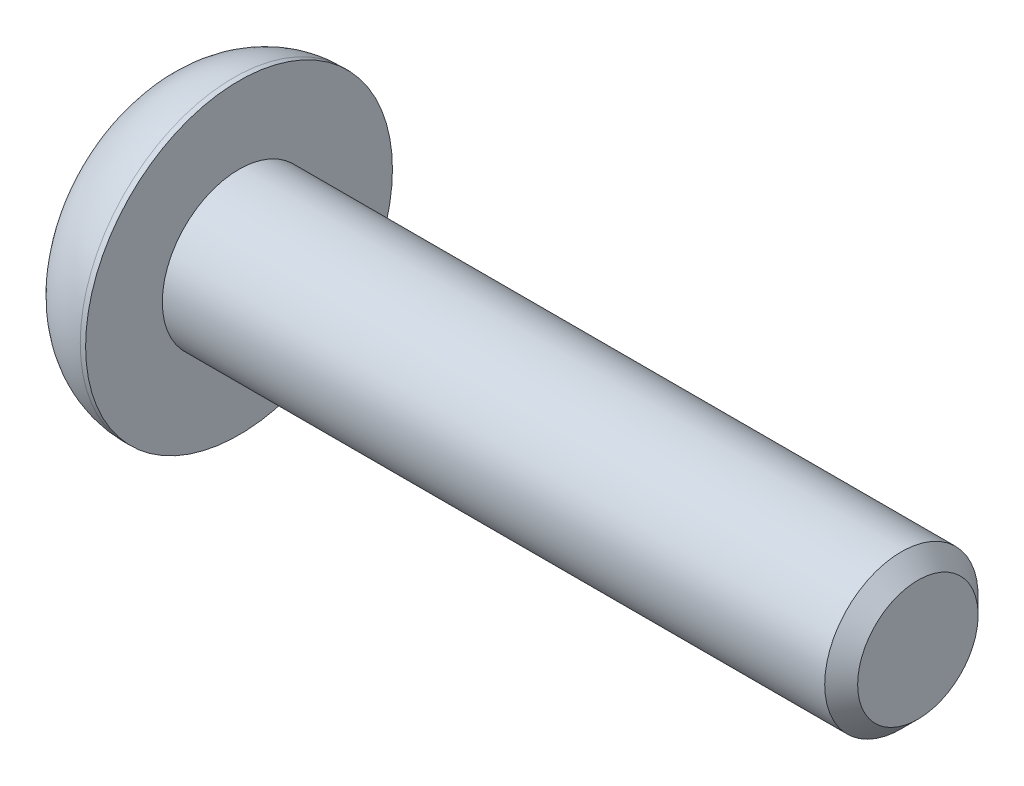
from build123d import *

# Parameters (mm, degrees)
EXTRUSION1_DEPTH = 1.495


with BuildPart() as part:
    # Esquisse1 → R_volution1 (revolve)
    with BuildSketch(Plane.XY, mode=Mode.PRIVATE) as r_volution1_sk:
        with BuildLine():
            Line((0, 0), (0, 1.84))
            ThreePointArc((0, 1.84), (0.632649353, 3.367350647), (2.16, 4))
            Line((2.16, 4), (2.3, 4))
            Line((2.3, 4), (2.3, 2))
            Line((2.3, 2), (19.5705, 2))
            Line((19.5705, 2), (20, 1.5705))
            Line((20, 1.5705), (20, 0))
            Line((20, 0), (0, 0))
        make_face()
    revolve(r_volution1_sk.sketch.rotate(Axis((20, 0, 0), (-1, 0, 0)), 270), axis=Axis((20, 0, 0), (-1, 0, 0)))

    # Esquisse2 → Extrusion1 (cut)
    with BuildSketch(Plane(origin=(0, 0, 0), x_dir=(0, 0, -1), z_dir=(1, 0, 0))):
        Polygon((-1.25, 0.721687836), (-1.25, -0.721687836), (0, -1.443375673), (1.25, -0.721687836), (1.25, 0.721687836), (0, 1.443375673), align=None)
    extrude(amount=EXTRUSION1_DEPTH, mode=Mode.SUBTRACT)

    # Esquisse3 → Enl_vement de mati_re-R_volution1 (revolve, cut)
    with BuildSketch(Plane.XY, mode=Mode.PRIVATE) as enl_vement_de_mati_re_r_volution1_sk:
        Polygon((0, 0), (0, 1.25), (1.578312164, 1.25), (2.3, 0), align=None)
    revolve(enl_vement_de_mati_re_r_volution1_sk.sketch.rotate(Axis((2.3, 0, 0), (-1, 0, 0)), 270), axis=Axis((2.3, 0, 0), (-1, 0, 0)), mode=Mode.SUBTRACT)


solid = part.part
